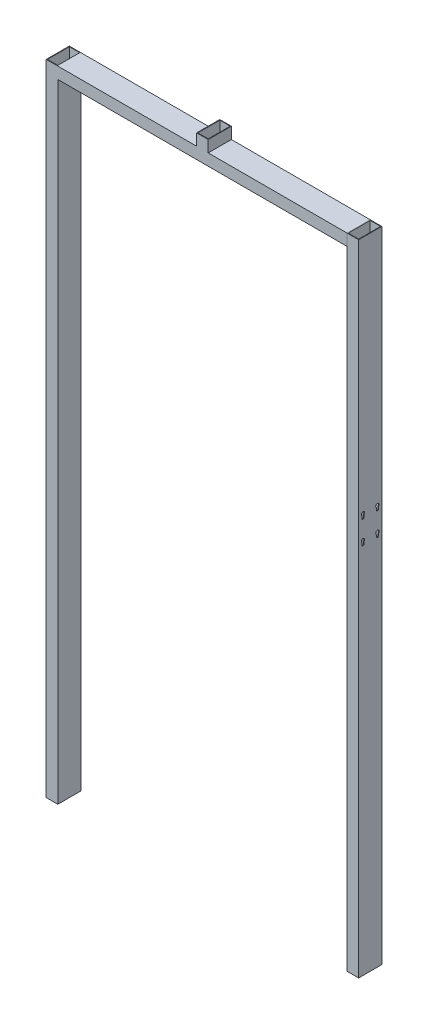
from build123d import *

# Parameters (mm, degrees)
ESQUISSE1_W        = 40
ESQUISSE1_H        = 80
ESQUISSE1_W_2      = 36
ESQUISSE1_H_2      = 76
EXTRUSION1_DEPTH   = 2210
EXTRUSION1_2_DEPTH = 2210
EXTRUSION2_REACH   = 2444.806
ESQUISSE2_W        = 80
ESQUISSE2_H        = 40
ESQUISSE2_W_2      = 76
ESQUISSE2_H_2      = 36
ESQUISSE3_W        = 40
ESQUISSE3_H        = 80
ESQUISSE3_W_2      = 36
ESQUISSE3_H_2      = 76
EXTRUSION3_DEPTH   = 40
EXTRUSION9_DEPTH   = 5


with BuildPart() as part:
    # Esquisse1 → Extrusion1 (new body)
    with BuildSketch(Plane(origin=(0, 0, 0), x_dir=(1, 0, 0), z_dir=(0, 1, 0))):
        with Locations((520, 0)):
            Rectangle(ESQUISSE1_W, ESQUISSE1_H)
        with Locations((520, 0)):
            Rectangle(ESQUISSE1_W_2, ESQUISSE1_H_2, mode=Mode.SUBTRACT)
    extrude(amount=EXTRUSION1_DEPTH)


with BuildPart() as body_2:
    # Esquisse1 → Extrusion1 2 (new body)
    with BuildSketch(Plane(origin=(0, 0, 0), x_dir=(1, 0, 0), z_dir=(0, 1, 0))):
        with Locations((-520, 0)):
            Rectangle(ESQUISSE1_W, ESQUISSE1_H)
        with Locations((-520, 0)):
            Rectangle(ESQUISSE1_W_2, ESQUISSE1_H_2, mode=Mode.SUBTRACT)
    extrude(amount=EXTRUSION1_2_DEPTH)


    # Esquisse2 → Extrusion2 (add, up to next)
    with BuildSketch(Plane(origin=(-500, 0, 0), x_dir=(0, 0, -1), z_dir=(1, 0, 0)), mode=Mode.PRIVATE) as extrusion2_sk1:
        with Locations((0, 2190)):
            Rectangle(ESQUISSE2_W, ESQUISSE2_H)
        with Locations((0, 2190)):
            Rectangle(ESQUISSE2_W_2, ESQUISSE2_H_2, mode=Mode.SUBTRACT)
    extrusion2_tool1 = extrude(extrusion2_sk1.sketch, amount=EXTRUSION2_REACH, mode=Mode.PRIVATE) - part.part
    add(extrusion2_tool1.solids().sort_by_distance((-500, 2209.105573, 0))[0])

    # Esquisse3 → Extrusion3 (add)
    with BuildSketch(Plane(origin=(0, 2210, 0), x_dir=(1, 0, 0), z_dir=(0, 1, 0))):
        Rectangle(ESQUISSE3_W, ESQUISSE3_H)
        Rectangle(ESQUISSE3_W_2, ESQUISSE3_H_2, mode=Mode.SUBTRACT)
    extrude(amount=EXTRUSION3_DEPTH)

    # Esquisse7 → Extrusion9 (cut)
    with BuildSketch(Plane.ZY.offset(540)):
        with BuildLine():
            Line((-21, 1370), (-21, 1377.527864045))
            ThreePointArc((-21, 1377.527864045), (-25, 1388), (-29, 1377.527864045))
            Line((-29, 1377.527864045), (-29, 1370))
            ThreePointArc((-29, 1370), (-25, 1366), (-21, 1370))
        make_face()
        with BuildLine():
            Line((21, 1370), (21, 1377.527864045))
            ThreePointArc((21, 1377.527864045), (25, 1388), (29, 1377.527864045))
            Line((29, 1377.527864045), (29, 1370))
            ThreePointArc((29, 1370), (25, 1366), (21, 1370))
        make_face()
        with BuildLine():
            Line((-29, 1290), (-29, 1297.527864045))
            ThreePointArc((-29, 1297.527864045), (-25, 1308), (-21, 1297.527864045))
            Line((-21, 1297.527864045), (-21, 1290))
            ThreePointArc((-21, 1290), (-25, 1286), (-29, 1290))
        make_face()
        with BuildLine():
            Line((21, 1290), (21, 1297.527864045))
            ThreePointArc((21, 1297.527864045), (25, 1308), (29, 1297.527864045))
            Line((29, 1297.527864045), (29, 1290))
            ThreePointArc((29, 1290), (25, 1286), (21, 1290))
        make_face()
    extrusion9 = extrude(amount=-EXTRUSION9_DEPTH, mode=Mode.SUBTRACT)


with BuildPart() as part_1:
    add(part.part)

    # Sym_trie1: Extrusion9 across plane
    add(extrusion9.mirror(Plane(origin=(0, 0, 0), x_dir=(0, 0, 1), z_dir=(1, 0, 0))), mode=Mode.SUBTRACT)


solid = Compound([body_2.part, part_1.part])
